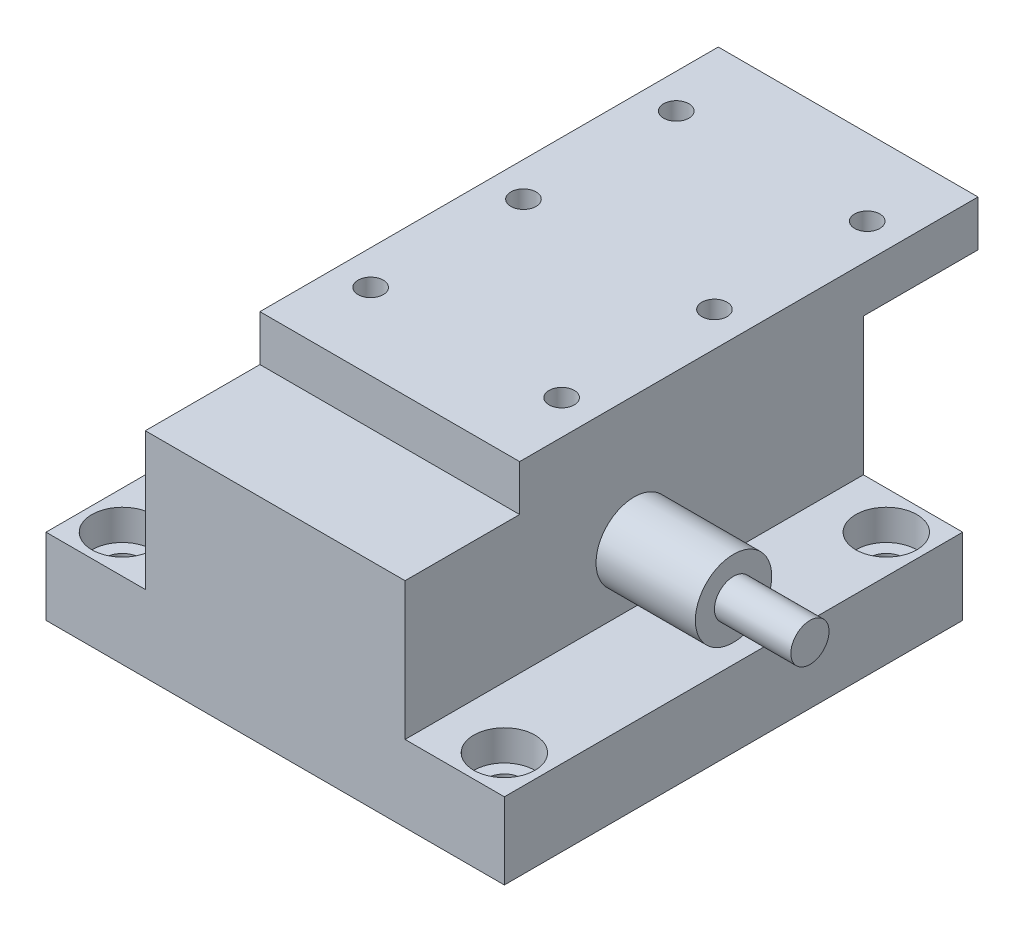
from build123d import *

# Parameters (mm, degrees)
SKETCH1_W                      = 60
SKETCH1_H                      = 10
BOSS_EXTRUDE1_DEPTH            = 30
SKETCH2_W                      = 34
SKETCH2_H                      = 60
BOSS_EXTRUDE2_DEPTH            = 18
SKETCH3_R                      = 5
BOSS_EXTRUDE3_DEPTH            = 13
CBORE_FOR_M4_SHCS1_D           = 4.5
CBORE_FOR_M4_SHCS1_CBORE_D     = 8
CBORE_FOR_M4_SHCS1_CBORE_DEPTH = 4
SKETCH10_W                     = 34
SKETCH10_H                     = 60
BOSS_EXTRUDE4_DEPTH            = 6
M4X0_7_TAPPED_HOLE1_D          = 3.3
M4X0_7_TAPPED_HOLE1_DEPTH      = 7
M4X0_7_TAPPED_HOLE1_TIP        = 0.991420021
SKETCH13_R                     = 2.5
BOSS_EXTRUDE5_DEPTH            = 10


with BuildPart() as part:
    # Sketch1 → Boss-Extrude1 (new, symmetric)
    with BuildSketch(Plane(origin=(0, 0, 0), x_dir=(0, 0, -1), z_dir=(1, 0, 0))):
        with Locations((30, 5)):
            Rectangle(SKETCH1_W, SKETCH1_H)
    extrude(amount=BOSS_EXTRUDE1_DEPTH, both=True)

    # Sketch2 → Boss-Extrude2 (add)
    with BuildSketch(Plane(origin=(0, 10, 0), x_dir=(1, 0, 0), z_dir=(0, 1, 0))):
        with Locations((0, 30)):
            Rectangle(SKETCH2_W, SKETCH2_H)
    extrude(amount=BOSS_EXTRUDE2_DEPTH)

    # Sketch3 → Boss-Extrude3 (add)
    with BuildSketch(Plane(origin=(17, 0, 0), x_dir=(0, 0, -1), z_dir=(1, 0, 0))):
        with Locations(Location((30, 17.5, 0), (0, 0, 180))):
            Circle(SKETCH3_R)
    extrude(amount=BOSS_EXTRUDE3_DEPTH)

    # CBORE for M4 SHCS1 (through all)
    with Locations(Plane(origin=(0, 10, 0), x_dir=(1, 0, 0), z_dir=(0, 1, 0))):
        with Locations((-25, 55), (-25, 5), (25, 5), (25, 55)):
            CounterBoreHole(CBORE_FOR_M4_SHCS1_D / 2, CBORE_FOR_M4_SHCS1_CBORE_D / 2, CBORE_FOR_M4_SHCS1_CBORE_DEPTH)

    # Sketch10 → Boss-Extrude4 (add)
    with BuildSketch(Plane(origin=(0, 28, 0), x_dir=(1, 0, 0), z_dir=(0, 1, 0))):
        with Locations((0, 45)):
            Rectangle(SKETCH10_W, SKETCH10_H)
    extrude(amount=BOSS_EXTRUDE4_DEPTH)

    # M4x0.7 Tapped Hole1
    with Locations(Plane(origin=(0, 34, 0), x_dir=(1, 0, 0), z_dir=(0, 1, 0))):
        with Locations((-12.5, 65), (12.5, 65), (12.5, 45), (-12.5, 45), (-12.5, 25), (12.5, 25)):
            Hole(M4X0_7_TAPPED_HOLE1_D / 2, depth=M4X0_7_TAPPED_HOLE1_DEPTH)
            with Locations((0, 0, -(M4X0_7_TAPPED_HOLE1_DEPTH + M4X0_7_TAPPED_HOLE1_TIP / 2))):  # 118° drill point
                Cone(0, M4X0_7_TAPPED_HOLE1_D / 2, M4X0_7_TAPPED_HOLE1_TIP, mode=Mode.SUBTRACT)

    # Sketch13 → Boss-Extrude5 (add)
    with BuildSketch(Plane(origin=(30, 0, 0), x_dir=(0, 0, -1), z_dir=(1, 0, 0))):
        with Locations((30, 17.5)):
            Circle(SKETCH13_R)
    extrude(amount=BOSS_EXTRUDE5_DEPTH)


solid = part.part
